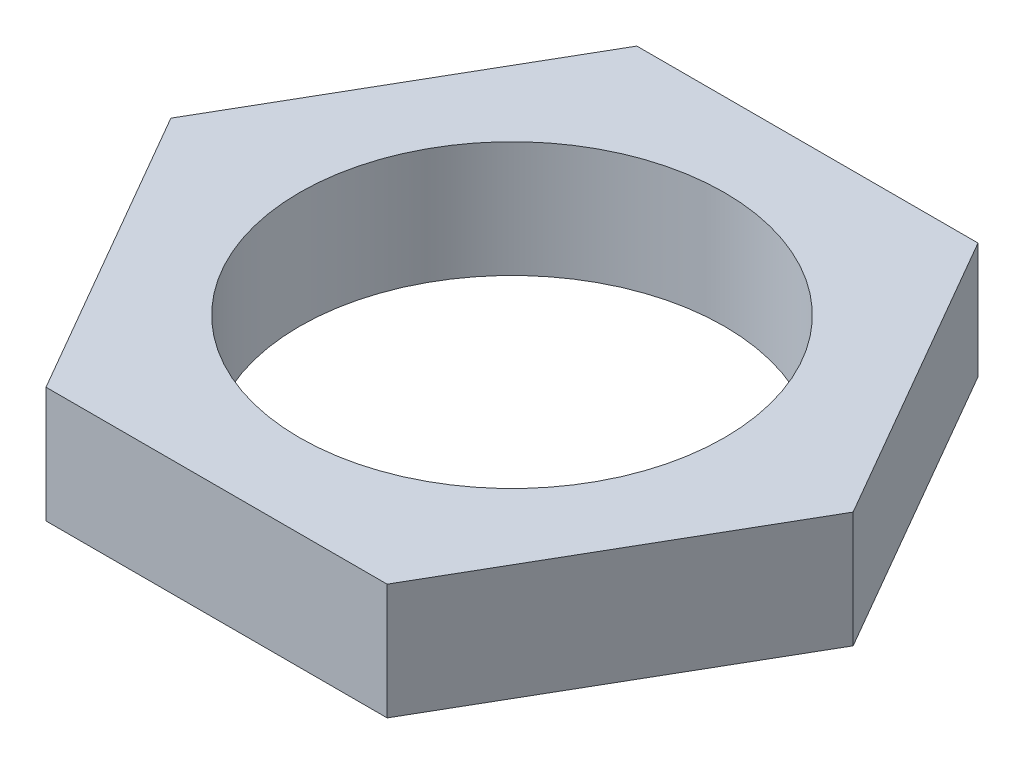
ISO-10303-21;
HEADER;
FILE_DESCRIPTION(('STEP AP214'),'2;1');
FILE_NAME('part.step','',(''),(''),'','','');
FILE_SCHEMA(('AUTOMOTIVE_DESIGN { 1 0 10303 214 1 1 1 1 }'));
ENDSEC;
DATA;
#1=APPLICATION_CONTEXT('core data for automotive mechanical design processes');
#2=APPLICATION_PROTOCOL_DEFINITION('international standard','automotive_design',2000,#1);
#3=PRODUCT_CONTEXT('',#1,'mechanical');
#4=PRODUCT('Part','Part','',(#3));
#5=PRODUCT_RELATED_PRODUCT_CATEGORY('part','',(#4));
#6=PRODUCT_DEFINITION_FORMATION('','',#4);
#7=PRODUCT_DEFINITION_CONTEXT('part definition',#1,'design');
#8=PRODUCT_DEFINITION('design','',#6,#7);
#9=PRODUCT_DEFINITION_SHAPE('','',#8);
#10=(LENGTH_UNIT() NAMED_UNIT(*) SI_UNIT(.MILLI.,.METRE.));
#11=(NAMED_UNIT(*) PLANE_ANGLE_UNIT() SI_UNIT($,.RADIAN.));
#12=(NAMED_UNIT(*) SI_UNIT($,.STERADIAN.) SOLID_ANGLE_UNIT());
#13=UNCERTAINTY_MEASURE_WITH_UNIT(LENGTH_MEASURE(1.E-05),#10,'distance_accuracy_value','');
#14=(GEOMETRIC_REPRESENTATION_CONTEXT(3) GLOBAL_UNCERTAINTY_ASSIGNED_CONTEXT((#13)) GLOBAL_UNIT_ASSIGNED_CONTEXT((#10,
#11,#12)) REPRESENTATION_CONTEXT('',''));
#15=CARTESIAN_POINT('',(0.,0.,0.));
#16=DIRECTION('',(0.,0.,1.));
#17=DIRECTION('',(1.,0.,0.));
#18=AXIS2_PLACEMENT_3D('',#15,#16,#17);
#19=CARTESIAN_POINT('',(4.41672955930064,1.5,7.65));
#20=DIRECTION('',(0.,-1.,0.));
#21=DIRECTION('',(0.,0.,-1.));
#22=AXIS2_PLACEMENT_3D('',#19,#20,#21);
#23=PLANE('',#22);
#24=DIRECTION('',(0.5,0.,-0.866025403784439));
#25=VECTOR('',#24,1.);
#26=CARTESIAN_POINT('',(4.41672955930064,1.5,7.65));
#27=LINE('',#26,#25);
#28=CARTESIAN_POINT('',(4.41672955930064,1.5,7.65));
#29=VERTEX_POINT('',#28);
#30=CARTESIAN_POINT('',(8.83345911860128,1.5,0.));
#31=VERTEX_POINT('',#30);
#32=EDGE_CURVE('E114',#29,#31,#27,.T.);
#33=ORIENTED_EDGE('',*,*,#32,.T.);
#34=DIRECTION('',(-0.5,0.,-0.866025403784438));
#35=VECTOR('',#34,1.);
#36=CARTESIAN_POINT('',(8.83345911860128,1.5,0.));
#37=LINE('',#36,#35);
#38=CARTESIAN_POINT('',(4.41672955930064,1.5,-7.65));
#39=VERTEX_POINT('',#38);
#40=EDGE_CURVE('E95',#31,#39,#37,.T.);
#41=ORIENTED_EDGE('',*,*,#40,.T.);
#42=DIRECTION('',(-1.,0.,0.));
#43=VECTOR('',#42,1.);
#44=CARTESIAN_POINT('',(4.41672955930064,1.5,-7.65));
#45=LINE('',#44,#43);
#46=CARTESIAN_POINT('',(-4.41672955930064,1.5,-7.65));
#47=VERTEX_POINT('',#46);
#48=EDGE_CURVE('E117',#39,#47,#45,.T.);
#49=ORIENTED_EDGE('',*,*,#48,.T.);
#50=DIRECTION('',(-0.5,0.,0.866025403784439));
#51=VECTOR('',#50,1.);
#52=CARTESIAN_POINT('',(-4.41672955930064,1.5,-7.65));
#53=LINE('',#52,#51);
#54=CARTESIAN_POINT('',(-8.83345911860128,1.5,0.));
#55=VERTEX_POINT('',#54);
#56=EDGE_CURVE('E119',#47,#55,#53,.T.);
#57=ORIENTED_EDGE('',*,*,#56,.T.);
#58=DIRECTION('',(0.5,0.,0.866025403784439));
#59=VECTOR('',#58,1.);
#60=CARTESIAN_POINT('',(-8.83345911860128,1.5,0.));
#61=LINE('',#60,#59);
#62=CARTESIAN_POINT('',(-4.41672955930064,1.5,7.65));
#63=VERTEX_POINT('',#62);
#64=EDGE_CURVE('E48',#55,#63,#61,.T.);
#65=ORIENTED_EDGE('',*,*,#64,.T.);
#66=DIRECTION('',(1.,0.,0.));
#67=VECTOR('',#66,1.);
#68=CARTESIAN_POINT('',(-4.41672955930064,1.5,7.65));
#69=LINE('',#68,#67);
#70=EDGE_CURVE('E43',#63,#29,#69,.T.);
#71=ORIENTED_EDGE('',*,*,#70,.T.);
#72=EDGE_LOOP('',(#33,#41,#49,#57,#65,#71));
#73=FACE_BOUND('',#72,.T.);
#74=CARTESIAN_POINT('',(0.,1.5,0.));
#75=DIRECTION('',(0.,1.,0.));
#76=DIRECTION('',(0.,0.,1.));
#77=AXIS2_PLACEMENT_3D('',#74,#75,#76);
#78=CIRCLE('',#77,5.5);
#79=CARTESIAN_POINT('',(0.,1.5,5.5));
#80=VERTEX_POINT('',#79);
#81=EDGE_CURVE('E100',#80,#80,#78,.T.);
#82=ORIENTED_EDGE('',*,*,#81,.F.);
#83=EDGE_LOOP('',(#82));
#84=FACE_BOUND('',#83,.T.);
#85=ADVANCED_FACE('F28',(#73,#84),#23,.F.);
#86=CARTESIAN_POINT('',(4.41672955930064,-1.5,7.65));
#87=DIRECTION('',(0.,-1.,0.));
#88=DIRECTION('',(0.,0.,-1.));
#89=AXIS2_PLACEMENT_3D('',#86,#87,#88);
#90=PLANE('',#89);
#91=DIRECTION('',(0.5,0.,-0.866025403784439));
#92=VECTOR('',#91,1.);
#93=CARTESIAN_POINT('',(4.41672955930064,-1.5,7.65));
#94=LINE('',#93,#92);
#95=CARTESIAN_POINT('',(4.41672955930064,-1.5,7.65));
#96=VERTEX_POINT('',#95);
#97=CARTESIAN_POINT('',(8.83345911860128,-1.5,0.));
#98=VERTEX_POINT('',#97);
#99=EDGE_CURVE('E86',#96,#98,#94,.T.);
#100=ORIENTED_EDGE('',*,*,#99,.F.);
#101=DIRECTION('',(1.,0.,0.));
#102=VECTOR('',#101,1.);
#103=CARTESIAN_POINT('',(-4.41672955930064,-1.5,7.65));
#104=LINE('',#103,#102);
#105=CARTESIAN_POINT('',(-4.41672955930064,-1.5,7.65));
#106=VERTEX_POINT('',#105);
#107=EDGE_CURVE('E112',#106,#96,#104,.T.);
#108=ORIENTED_EDGE('',*,*,#107,.F.);
#109=DIRECTION('',(0.5,0.,0.866025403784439));
#110=VECTOR('',#109,1.);
#111=CARTESIAN_POINT('',(-8.83345911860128,-1.5,0.));
#112=LINE('',#111,#110);
#113=CARTESIAN_POINT('',(-8.83345911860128,-1.5,0.));
#114=VERTEX_POINT('',#113);
#115=EDGE_CURVE('E110',#114,#106,#112,.T.);
#116=ORIENTED_EDGE('',*,*,#115,.F.);
#117=DIRECTION('',(-0.5,0.,0.866025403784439));
#118=VECTOR('',#117,1.);
#119=CARTESIAN_POINT('',(-4.41672955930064,-1.5,-7.65));
#120=LINE('',#119,#118);
#121=CARTESIAN_POINT('',(-4.41672955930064,-1.5,-7.65));
#122=VERTEX_POINT('',#121);
#123=EDGE_CURVE('E108',#122,#114,#120,.T.);
#124=ORIENTED_EDGE('',*,*,#123,.F.);
#125=DIRECTION('',(-1.,0.,0.));
#126=VECTOR('',#125,1.);
#127=CARTESIAN_POINT('',(4.41672955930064,-1.5,-7.65));
#128=LINE('',#127,#126);
#129=CARTESIAN_POINT('',(4.41672955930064,-1.5,-7.65));
#130=VERTEX_POINT('',#129);
#131=EDGE_CURVE('E88',#130,#122,#128,.T.);
#132=ORIENTED_EDGE('',*,*,#131,.F.);
#133=DIRECTION('',(-0.5,0.,-0.866025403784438));
#134=VECTOR('',#133,1.);
#135=CARTESIAN_POINT('',(8.83345911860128,-1.5,0.));
#136=LINE('',#135,#134);
#137=EDGE_CURVE('E81',#98,#130,#136,.T.);
#138=ORIENTED_EDGE('',*,*,#137,.F.);
#139=EDGE_LOOP('',(#100,#108,#116,#124,#132,#138));
#140=FACE_BOUND('',#139,.T.);
#141=CARTESIAN_POINT('',(0.,-1.5,0.));
#142=DIRECTION('',(0.,1.,0.));
#143=DIRECTION('',(0.,0.,1.));
#144=AXIS2_PLACEMENT_3D('',#141,#142,#143);
#145=CIRCLE('',#144,5.5);
#146=CARTESIAN_POINT('',(0.,-1.5,5.5));
#147=VERTEX_POINT('',#146);
#148=EDGE_CURVE('E103',#147,#147,#145,.T.);
#149=ORIENTED_EDGE('',*,*,#148,.T.);
#150=EDGE_LOOP('',(#149));
#151=FACE_BOUND('',#150,.T.);
#152=ADVANCED_FACE('F82',(#140,#151),#90,.T.);
#153=CARTESIAN_POINT('',(4.41672955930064,1.5,7.65));
#154=DIRECTION('',(-0.866025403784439,0.,-0.5));
#155=DIRECTION('',(-0.5,0.,0.866025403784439));
#156=AXIS2_PLACEMENT_3D('',#153,#154,#155);
#157=PLANE('',#156);
#158=ORIENTED_EDGE('',*,*,#99,.T.);
#159=DIRECTION('',(0.,-1.,0.));
#160=VECTOR('',#159,1.);
#161=CARTESIAN_POINT('',(8.83345911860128,1.5,0.));
#162=LINE('',#161,#160);
#163=EDGE_CURVE('E11',#31,#98,#162,.T.);
#164=ORIENTED_EDGE('',*,*,#163,.F.);
#165=ORIENTED_EDGE('',*,*,#32,.F.);
#166=DIRECTION('',(0.,-1.,0.));
#167=VECTOR('',#166,1.);
#168=CARTESIAN_POINT('',(4.41672955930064,1.5,7.65));
#169=LINE('',#168,#167);
#170=EDGE_CURVE('E99',#29,#96,#169,.T.);
#171=ORIENTED_EDGE('',*,*,#170,.T.);
#172=EDGE_LOOP('',(#158,#164,#165,#171));
#173=FACE_BOUND('',#172,.T.);
#174=ADVANCED_FACE('F30',(#173),#157,.F.);
#175=CARTESIAN_POINT('',(8.83345911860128,1.5,0.));
#176=DIRECTION('',(-0.866025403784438,0.,0.5));
#177=DIRECTION('',(0.5,0.,0.866025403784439));
#178=AXIS2_PLACEMENT_3D('',#175,#176,#177);
#179=PLANE('',#178);
#180=ORIENTED_EDGE('',*,*,#137,.T.);
#181=DIRECTION('',(0.,-1.,0.));
#182=VECTOR('',#181,1.);
#183=CARTESIAN_POINT('',(4.41672955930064,1.5,-7.65));
#184=LINE('',#183,#182);
#185=EDGE_CURVE('E36',#39,#130,#184,.T.);
#186=ORIENTED_EDGE('',*,*,#185,.F.);
#187=ORIENTED_EDGE('',*,*,#40,.F.);
#188=ORIENTED_EDGE('',*,*,#163,.T.);
#189=EDGE_LOOP('',(#180,#186,#187,#188));
#190=FACE_BOUND('',#189,.T.);
#191=ADVANCED_FACE('F94',(#190),#179,.F.);
#192=CARTESIAN_POINT('',(4.41672955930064,1.5,-7.65));
#193=DIRECTION('',(0.,0.,1.));
#194=DIRECTION('',(1.,0.,0.));
#195=AXIS2_PLACEMENT_3D('',#192,#193,#194);
#196=PLANE('',#195);
#197=ORIENTED_EDGE('',*,*,#131,.T.);
#198=DIRECTION('',(0.,-1.,0.));
#199=VECTOR('',#198,1.);
#200=CARTESIAN_POINT('',(-4.41672955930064,1.5,-7.65));
#201=LINE('',#200,#199);
#202=EDGE_CURVE('E130',#47,#122,#201,.T.);
#203=ORIENTED_EDGE('',*,*,#202,.F.);
#204=ORIENTED_EDGE('',*,*,#48,.F.);
#205=ORIENTED_EDGE('',*,*,#185,.T.);
#206=EDGE_LOOP('',(#197,#203,#204,#205));
#207=FACE_BOUND('',#206,.T.);
#208=ADVANCED_FACE('F134',(#207),#196,.F.);
#209=CARTESIAN_POINT('',(-4.41672955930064,1.5,-7.65));
#210=DIRECTION('',(0.866025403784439,0.,0.5));
#211=DIRECTION('',(0.5,0.,-0.866025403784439));
#212=AXIS2_PLACEMENT_3D('',#209,#210,#211);
#213=PLANE('',#212);
#214=ORIENTED_EDGE('',*,*,#123,.T.);
#215=DIRECTION('',(0.,-1.,0.));
#216=VECTOR('',#215,1.);
#217=CARTESIAN_POINT('',(-8.83345911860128,1.5,0.));
#218=LINE('',#217,#216);
#219=EDGE_CURVE('E127',#55,#114,#218,.T.);
#220=ORIENTED_EDGE('',*,*,#219,.F.);
#221=ORIENTED_EDGE('',*,*,#56,.F.);
#222=ORIENTED_EDGE('',*,*,#202,.T.);
#223=EDGE_LOOP('',(#214,#220,#221,#222));
#224=FACE_BOUND('',#223,.T.);
#225=ADVANCED_FACE('F140',(#224),#213,.F.);
#226=CARTESIAN_POINT('',(-8.83345911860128,1.5,0.));
#227=DIRECTION('',(0.866025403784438,0.,-0.5));
#228=DIRECTION('',(-0.5,0.,-0.866025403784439));
#229=AXIS2_PLACEMENT_3D('',#226,#227,#228);
#230=PLANE('',#229);
#231=ORIENTED_EDGE('',*,*,#115,.T.);
#232=DIRECTION('',(0.,-1.,0.));
#233=VECTOR('',#232,1.);
#234=CARTESIAN_POINT('',(-4.41672955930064,1.5,7.65));
#235=LINE('',#234,#233);
#236=EDGE_CURVE('E124',#63,#106,#235,.T.);
#237=ORIENTED_EDGE('',*,*,#236,.F.);
#238=ORIENTED_EDGE('',*,*,#64,.F.);
#239=ORIENTED_EDGE('',*,*,#219,.T.);
#240=EDGE_LOOP('',(#231,#237,#238,#239));
#241=FACE_BOUND('',#240,.T.);
#242=ADVANCED_FACE('F143',(#241),#230,.F.);
#243=CARTESIAN_POINT('',(-4.41672955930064,1.5,7.65));
#244=DIRECTION('',(0.,0.,-1.));
#245=DIRECTION('',(-1.,0.,0.));
#246=AXIS2_PLACEMENT_3D('',#243,#244,#245);
#247=PLANE('',#246);
#248=ORIENTED_EDGE('',*,*,#107,.T.);
#249=ORIENTED_EDGE('',*,*,#170,.F.);
#250=ORIENTED_EDGE('',*,*,#70,.F.);
#251=ORIENTED_EDGE('',*,*,#236,.T.);
#252=EDGE_LOOP('',(#248,#249,#250,#251));
#253=FACE_BOUND('',#252,.T.);
#254=ADVANCED_FACE('F145',(#253),#247,.F.);
#255=CARTESIAN_POINT('',(0.,1.5,0.));
#256=DIRECTION('',(0.,-1.,0.));
#257=DIRECTION('',(0.,0.,-1.));
#258=AXIS2_PLACEMENT_3D('',#255,#256,#257);
#259=CYLINDRICAL_SURFACE('',#258,5.5);
#260=ORIENTED_EDGE('',*,*,#81,.T.);
#261=EDGE_LOOP('',(#260));
#262=FACE_BOUND('',#261,.T.);
#263=ORIENTED_EDGE('',*,*,#148,.F.);
#264=EDGE_LOOP('',(#263));
#265=FACE_BOUND('',#264,.T.);
#266=ADVANCED_FACE('F147',(#262,#265),#259,.F.);
#267=CLOSED_SHELL('',(#85,#152,#174,#191,#208,#225,#242,#254,#266));
#268=MANIFOLD_SOLID_BREP('B2',#267);
#269=ADVANCED_BREP_SHAPE_REPRESENTATION('',(#18,#268),#14);
#270=SHAPE_DEFINITION_REPRESENTATION(#9,#269);
ENDSEC;
END-ISO-10303-21;
